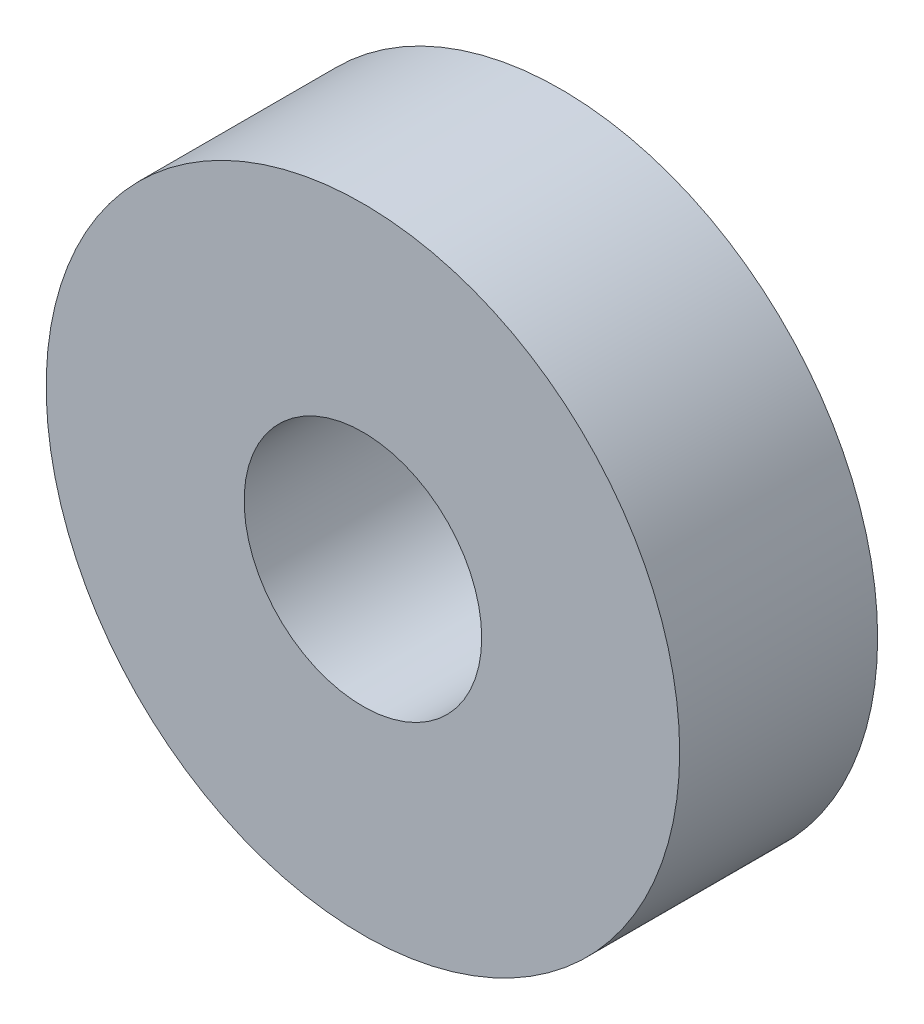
from build123d import *

# Parameters (mm, degrees)
CROQUIS1_R     = 16
CROQUIS1_R_2   = 6
EXTRUIR1_DEPTH = 10


with BuildPart() as part:
    # Croquis1 → Extruir1 (new body)
    with BuildSketch(Plane.XY):
        Circle(CROQUIS1_R)
        Circle(CROQUIS1_R_2, mode=Mode.SUBTRACT)
    extrude(amount=EXTRUIR1_DEPTH)


solid = part.part
